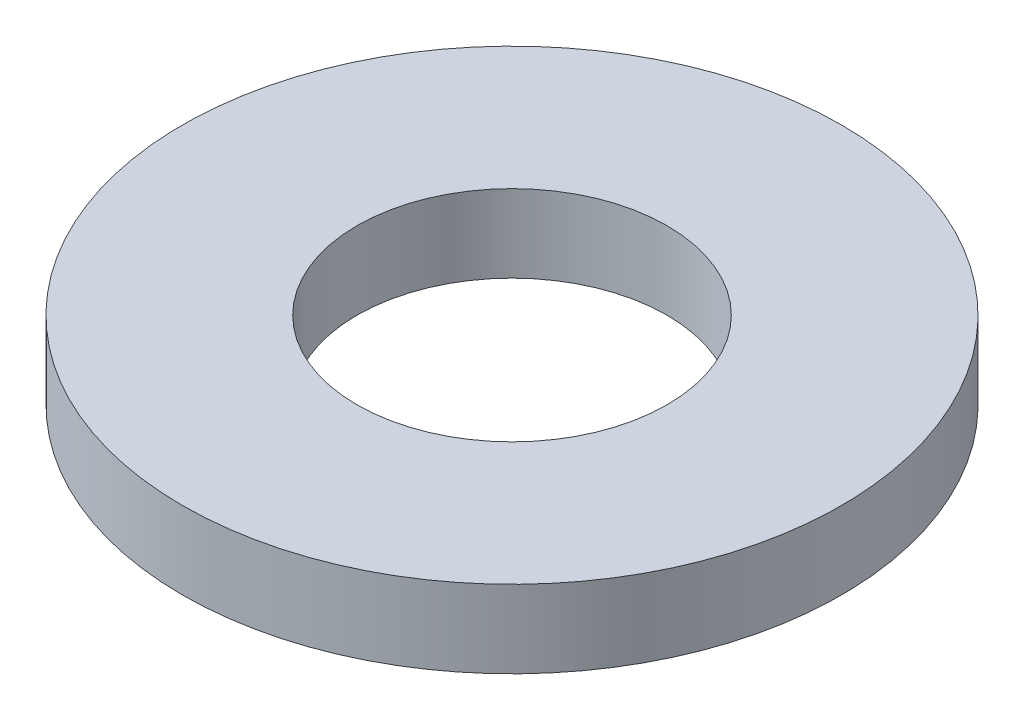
ISO-10303-21;
HEADER;
FILE_DESCRIPTION(('STEP AP214'),'2;1');
FILE_NAME('part.step','',(''),(''),'','','');
FILE_SCHEMA(('AUTOMOTIVE_DESIGN { 1 0 10303 214 1 1 1 1 }'));
ENDSEC;
DATA;
#1=APPLICATION_CONTEXT('core data for automotive mechanical design processes');
#2=APPLICATION_PROTOCOL_DEFINITION('international standard','automotive_design',2000,#1);
#3=PRODUCT_CONTEXT('',#1,'mechanical');
#4=PRODUCT('Part','Part','',(#3));
#5=PRODUCT_RELATED_PRODUCT_CATEGORY('part','',(#4));
#6=PRODUCT_DEFINITION_FORMATION('','',#4);
#7=PRODUCT_DEFINITION_CONTEXT('part definition',#1,'design');
#8=PRODUCT_DEFINITION('design','',#6,#7);
#9=PRODUCT_DEFINITION_SHAPE('','',#8);
#10=(LENGTH_UNIT() NAMED_UNIT(*) SI_UNIT(.MILLI.,.METRE.));
#11=(NAMED_UNIT(*) PLANE_ANGLE_UNIT() SI_UNIT($,.RADIAN.));
#12=(NAMED_UNIT(*) SI_UNIT($,.STERADIAN.) SOLID_ANGLE_UNIT());
#13=UNCERTAINTY_MEASURE_WITH_UNIT(LENGTH_MEASURE(1.E-05),#10,'distance_accuracy_value','');
#14=(GEOMETRIC_REPRESENTATION_CONTEXT(3) GLOBAL_UNCERTAINTY_ASSIGNED_CONTEXT((#13)) GLOBAL_UNIT_ASSIGNED_CONTEXT((#10,
#11,#12)) REPRESENTATION_CONTEXT('',''));
#15=CARTESIAN_POINT('',(0.,0.,0.));
#16=DIRECTION('',(0.,0.,1.));
#17=DIRECTION('',(1.,0.,0.));
#18=AXIS2_PLACEMENT_3D('',#15,#16,#17);
#19=CARTESIAN_POINT('',(0.,1.,0.));
#20=DIRECTION('',(0.,1.,0.));
#21=DIRECTION('',(0.,0.,1.));
#22=AXIS2_PLACEMENT_3D('',#19,#20,#21);
#23=PLANE('',#22);
#24=CARTESIAN_POINT('',(0.,1.,0.));
#25=DIRECTION('',(0.,1.,0.));
#26=DIRECTION('',(0.,0.,1.));
#27=AXIS2_PLACEMENT_3D('',#24,#25,#26);
#28=CIRCLE('',#27,4.25);
#29=CARTESIAN_POINT('',(0.,1.,4.25));
#30=VERTEX_POINT('',#29);
#31=EDGE_CURVE('E10',#30,#30,#28,.T.);
#32=ORIENTED_EDGE('',*,*,#31,.T.);
#33=EDGE_LOOP('',(#32));
#34=FACE_BOUND('',#33,.T.);
#35=CARTESIAN_POINT('',(0.,1.,0.));
#36=DIRECTION('',(0.,1.,0.));
#37=DIRECTION('',(0.,0.,1.));
#38=AXIS2_PLACEMENT_3D('',#35,#36,#37);
#39=CIRCLE('',#38,2.);
#40=CARTESIAN_POINT('',(0.,1.,2.));
#41=VERTEX_POINT('',#40);
#42=EDGE_CURVE('E43',#41,#41,#39,.T.);
#43=ORIENTED_EDGE('',*,*,#42,.F.);
#44=EDGE_LOOP('',(#43));
#45=FACE_BOUND('',#44,.T.);
#46=ADVANCED_FACE('F32',(#34,#45),#23,.T.);
#47=CARTESIAN_POINT('',(0.,0.,0.));
#48=DIRECTION('',(0.,1.,0.));
#49=DIRECTION('',(0.,0.,1.));
#50=AXIS2_PLACEMENT_3D('',#47,#48,#49);
#51=PLANE('',#50);
#52=CARTESIAN_POINT('',(0.,0.,0.));
#53=DIRECTION('',(0.,1.,0.));
#54=DIRECTION('',(0.,0.,1.));
#55=AXIS2_PLACEMENT_3D('',#52,#53,#54);
#56=CIRCLE('',#55,4.25);
#57=CARTESIAN_POINT('',(0.,0.,4.25));
#58=VERTEX_POINT('',#57);
#59=EDGE_CURVE('E36',#58,#58,#56,.T.);
#60=ORIENTED_EDGE('',*,*,#59,.F.);
#61=EDGE_LOOP('',(#60));
#62=FACE_BOUND('',#61,.T.);
#63=CARTESIAN_POINT('',(0.,0.,0.));
#64=DIRECTION('',(0.,1.,0.));
#65=DIRECTION('',(0.,0.,1.));
#66=AXIS2_PLACEMENT_3D('',#63,#64,#65);
#67=CIRCLE('',#66,2.);
#68=CARTESIAN_POINT('',(0.,0.,2.));
#69=VERTEX_POINT('',#68);
#70=EDGE_CURVE('E45',#69,#69,#67,.T.);
#71=ORIENTED_EDGE('',*,*,#70,.T.);
#72=EDGE_LOOP('',(#71));
#73=FACE_BOUND('',#72,.T.);
#74=ADVANCED_FACE('F55',(#62,#73),#51,.F.);
#75=CARTESIAN_POINT('',(0.,1.,0.));
#76=DIRECTION('',(0.,-1.,0.));
#77=DIRECTION('',(0.,0.,-1.));
#78=AXIS2_PLACEMENT_3D('',#75,#76,#77);
#79=CYLINDRICAL_SURFACE('',#78,4.25);
#80=ORIENTED_EDGE('',*,*,#31,.F.);
#81=EDGE_LOOP('',(#80));
#82=FACE_BOUND('',#81,.T.);
#83=ORIENTED_EDGE('',*,*,#59,.T.);
#84=EDGE_LOOP('',(#83));
#85=FACE_BOUND('',#84,.T.);
#86=ADVANCED_FACE('F34',(#82,#85),#79,.T.);
#87=CARTESIAN_POINT('',(0.,1.,0.));
#88=DIRECTION('',(0.,-1.,0.));
#89=DIRECTION('',(0.,0.,-1.));
#90=AXIS2_PLACEMENT_3D('',#87,#88,#89);
#91=CYLINDRICAL_SURFACE('',#90,2.);
#92=ORIENTED_EDGE('',*,*,#42,.T.);
#93=EDGE_LOOP('',(#92));
#94=FACE_BOUND('',#93,.T.);
#95=ORIENTED_EDGE('',*,*,#70,.F.);
#96=EDGE_LOOP('',(#95));
#97=FACE_BOUND('',#96,.T.);
#98=ADVANCED_FACE('F51',(#94,#97),#91,.F.);
#99=CLOSED_SHELL('',(#46,#74,#86,#98));
#100=MANIFOLD_SOLID_BREP('B2',#99);
#101=ADVANCED_BREP_SHAPE_REPRESENTATION('',(#18,#100),#14);
#102=SHAPE_DEFINITION_REPRESENTATION(#9,#101);
ENDSEC;
END-ISO-10303-21;
